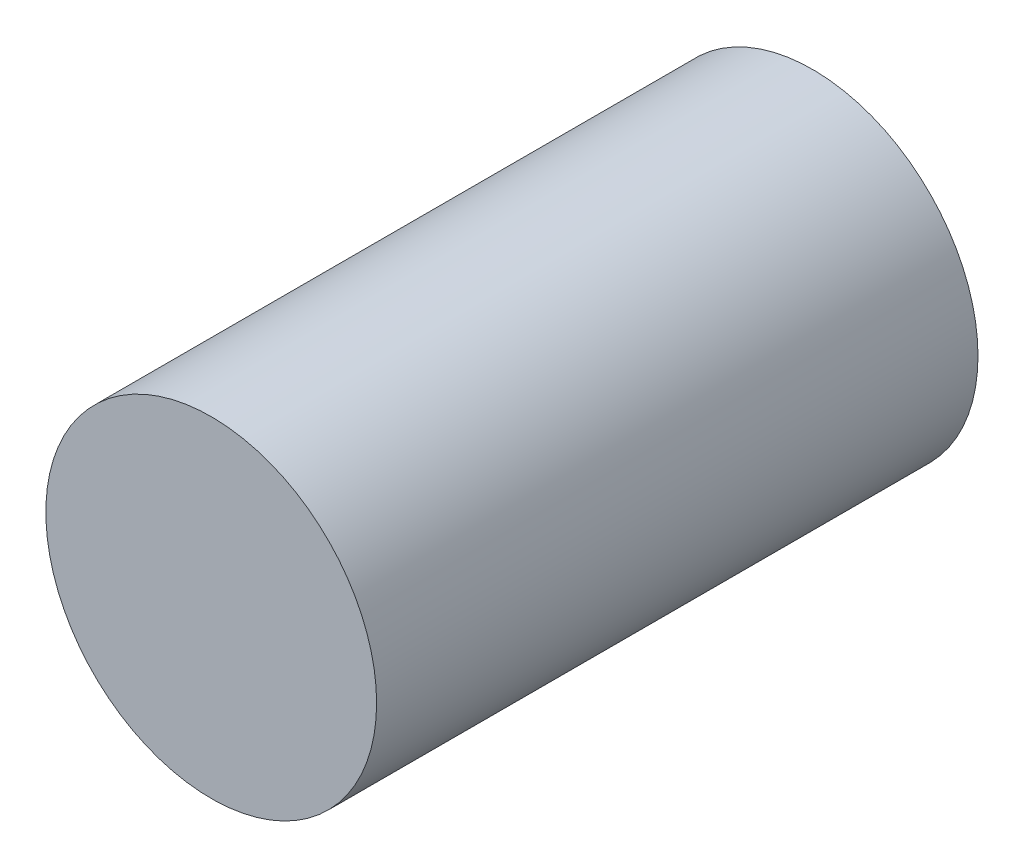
ISO-10303-21;
HEADER;
FILE_DESCRIPTION(('STEP AP214'),'2;1');
FILE_NAME('part.step','',(''),(''),'','','');
FILE_SCHEMA(('AUTOMOTIVE_DESIGN { 1 0 10303 214 1 1 1 1 }'));
ENDSEC;
DATA;
#1=APPLICATION_CONTEXT('core data for automotive mechanical design processes');
#2=APPLICATION_PROTOCOL_DEFINITION('international standard','automotive_design',2000,#1);
#3=PRODUCT_CONTEXT('',#1,'mechanical');
#4=PRODUCT('Part','Part','',(#3));
#5=PRODUCT_RELATED_PRODUCT_CATEGORY('part','',(#4));
#6=PRODUCT_DEFINITION_FORMATION('','',#4);
#7=PRODUCT_DEFINITION_CONTEXT('part definition',#1,'design');
#8=PRODUCT_DEFINITION('design','',#6,#7);
#9=PRODUCT_DEFINITION_SHAPE('','',#8);
#10=(LENGTH_UNIT() NAMED_UNIT(*) SI_UNIT(.MILLI.,.METRE.));
#11=(NAMED_UNIT(*) PLANE_ANGLE_UNIT() SI_UNIT($,.RADIAN.));
#12=(NAMED_UNIT(*) SI_UNIT($,.STERADIAN.) SOLID_ANGLE_UNIT());
#13=UNCERTAINTY_MEASURE_WITH_UNIT(LENGTH_MEASURE(1.E-05),#10,'distance_accuracy_value','');
#14=(GEOMETRIC_REPRESENTATION_CONTEXT(3) GLOBAL_UNCERTAINTY_ASSIGNED_CONTEXT((#13)) GLOBAL_UNIT_ASSIGNED_CONTEXT((#10,
#11,#12)) REPRESENTATION_CONTEXT('',''));
#15=CARTESIAN_POINT('',(0.,0.,0.));
#16=DIRECTION('',(0.,0.,1.));
#17=DIRECTION('',(1.,0.,0.));
#18=AXIS2_PLACEMENT_3D('',#15,#16,#17);
#19=CARTESIAN_POINT('',(0.,0.,0.));
#20=DIRECTION('',(0.,0.,1.));
#21=DIRECTION('',(1.,0.,0.));
#22=AXIS2_PLACEMENT_3D('',#19,#20,#21);
#23=PLANE('',#22);
#24=CARTESIAN_POINT('',(0.,0.,0.));
#25=DIRECTION('',(0.,0.,1.));
#26=DIRECTION('',(1.,0.,0.));
#27=AXIS2_PLACEMENT_3D('',#24,#25,#26);
#28=CIRCLE('',#27,11.);
#29=CARTESIAN_POINT('',(11.,0.,0.));
#30=VERTEX_POINT('',#29);
#31=EDGE_CURVE('E42',#30,#30,#28,.T.);
#32=ORIENTED_EDGE('',*,*,#31,.F.);
#33=EDGE_LOOP('',(#32));
#34=FACE_BOUND('',#33,.T.);
#35=CARTESIAN_POINT('',(0.,0.,0.));
#36=DIRECTION('',(0.,0.,1.));
#37=DIRECTION('',(1.,0.,0.));
#38=AXIS2_PLACEMENT_3D('',#35,#36,#37);
#39=CIRCLE('',#38,6.);
#40=CARTESIAN_POINT('',(6.,0.,0.));
#41=VERTEX_POINT('',#40);
#42=EDGE_CURVE('E10',#41,#41,#39,.F.);
#43=ORIENTED_EDGE('',*,*,#42,.F.);
#44=EDGE_LOOP('',(#43));
#45=FACE_BOUND('',#44,.T.);
#46=ADVANCED_FACE('F31',(#34,#45),#23,.F.);
#47=CARTESIAN_POINT('',(0.,0.,40.));
#48=DIRECTION('',(0.,0.,-1.));
#49=DIRECTION('',(-1.,0.,0.));
#50=AXIS2_PLACEMENT_3D('',#47,#48,#49);
#51=CYLINDRICAL_SURFACE('',#50,11.);
#52=CARTESIAN_POINT('',(0.,0.,40.));
#53=DIRECTION('',(0.,0.,1.));
#54=DIRECTION('',(1.,0.,0.));
#55=AXIS2_PLACEMENT_3D('',#52,#53,#54);
#56=CIRCLE('',#55,11.);
#57=CARTESIAN_POINT('',(11.,0.,40.));
#58=VERTEX_POINT('',#57);
#59=EDGE_CURVE('E38',#58,#58,#56,.T.);
#60=ORIENTED_EDGE('',*,*,#59,.F.);
#61=EDGE_LOOP('',(#60));
#62=FACE_BOUND('',#61,.T.);
#63=ORIENTED_EDGE('',*,*,#31,.T.);
#64=EDGE_LOOP('',(#63));
#65=FACE_BOUND('',#64,.T.);
#66=ADVANCED_FACE('F33',(#62,#65),#51,.T.);
#67=CARTESIAN_POINT('',(0.,0.,40.));
#68=DIRECTION('',(0.,0.,1.));
#69=DIRECTION('',(1.,0.,0.));
#70=AXIS2_PLACEMENT_3D('',#67,#68,#69);
#71=PLANE('',#70);
#72=ORIENTED_EDGE('',*,*,#59,.T.);
#73=EDGE_LOOP('',(#72));
#74=FACE_BOUND('',#73,.T.);
#75=ADVANCED_FACE('F56',(#74),#71,.T.);
#76=CARTESIAN_POINT('',(0.,0.,-1.));
#77=DIRECTION('',(0.,0.,1.));
#78=DIRECTION('',(1.,0.,0.));
#79=AXIS2_PLACEMENT_3D('',#76,#77,#78);
#80=CYLINDRICAL_SURFACE('',#79,6.);
#81=CARTESIAN_POINT('',(0.,0.,-1.));
#82=DIRECTION('',(0.,0.,-1.));
#83=DIRECTION('',(-1.,0.,0.));
#84=AXIS2_PLACEMENT_3D('',#81,#82,#83);
#85=CIRCLE('',#84,6.);
#86=CARTESIAN_POINT('',(-6.,0.,-1.));
#87=VERTEX_POINT('',#86);
#88=EDGE_CURVE('E46',#87,#87,#85,.T.);
#89=ORIENTED_EDGE('',*,*,#88,.F.);
#90=EDGE_LOOP('',(#89));
#91=FACE_BOUND('',#90,.T.);
#92=ORIENTED_EDGE('',*,*,#42,.T.);
#93=EDGE_LOOP('',(#92));
#94=FACE_BOUND('',#93,.T.);
#95=ADVANCED_FACE('F54',(#91,#94),#80,.T.);
#96=CARTESIAN_POINT('',(0.,0.,-1.));
#97=DIRECTION('',(0.,0.,-1.));
#98=DIRECTION('',(-1.,0.,0.));
#99=AXIS2_PLACEMENT_3D('',#96,#97,#98);
#100=PLANE('',#99);
#101=ORIENTED_EDGE('',*,*,#88,.T.);
#102=EDGE_LOOP('',(#101));
#103=FACE_BOUND('',#102,.T.);
#104=ADVANCED_FACE('F52',(#103),#100,.T.);
#105=CLOSED_SHELL('',(#46,#66,#75,#95,#104));
#106=MANIFOLD_SOLID_BREP('B2',#105);
#107=ADVANCED_BREP_SHAPE_REPRESENTATION('',(#18,#106),#14);
#108=SHAPE_DEFINITION_REPRESENTATION(#9,#107);
ENDSEC;
END-ISO-10303-21;
